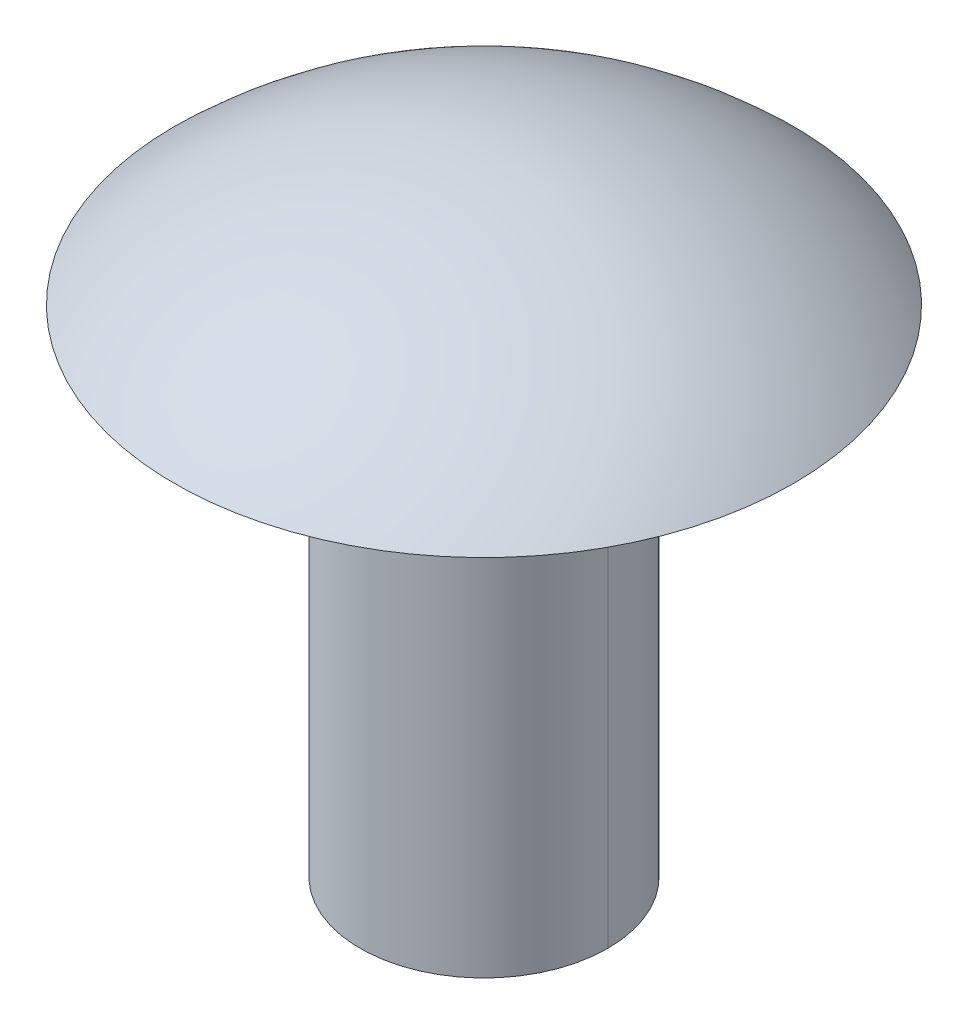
from build123d import *

# Parameters (mm, degrees)
SKETCH1_R           = 4.7625
BOSS_EXTRUDE1_DEPTH = 19.05


with BuildPart() as part:
    # Sketch1 → Boss-Extrude1 (new body)
    with BuildSketch(Plane(origin=(0, 0, 0), x_dir=(1, 0, 0), z_dir=(0, 1, 0))):
        with Locations(Location((0, 0, 0), (0, 0, 270))):
            Circle(SKETCH1_R)
    extrude(amount=-BOSS_EXTRUDE1_DEPTH)

    # Sketch3 → Revolve1 (revolve)
    with BuildSketch(Plane.XY):
        with BuildLine():
            Line((0, 4.7498), (0, 0))
            Line((0, 0), (11.8999, 0))
            ThreePointArc((11.8999, 0), (6.406407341, 3.5184843), (0, 4.7498))
        make_face()
    revolve(axis=Axis((0, 4.7498, 0), (0, -1, 0)))


solid = part.part
